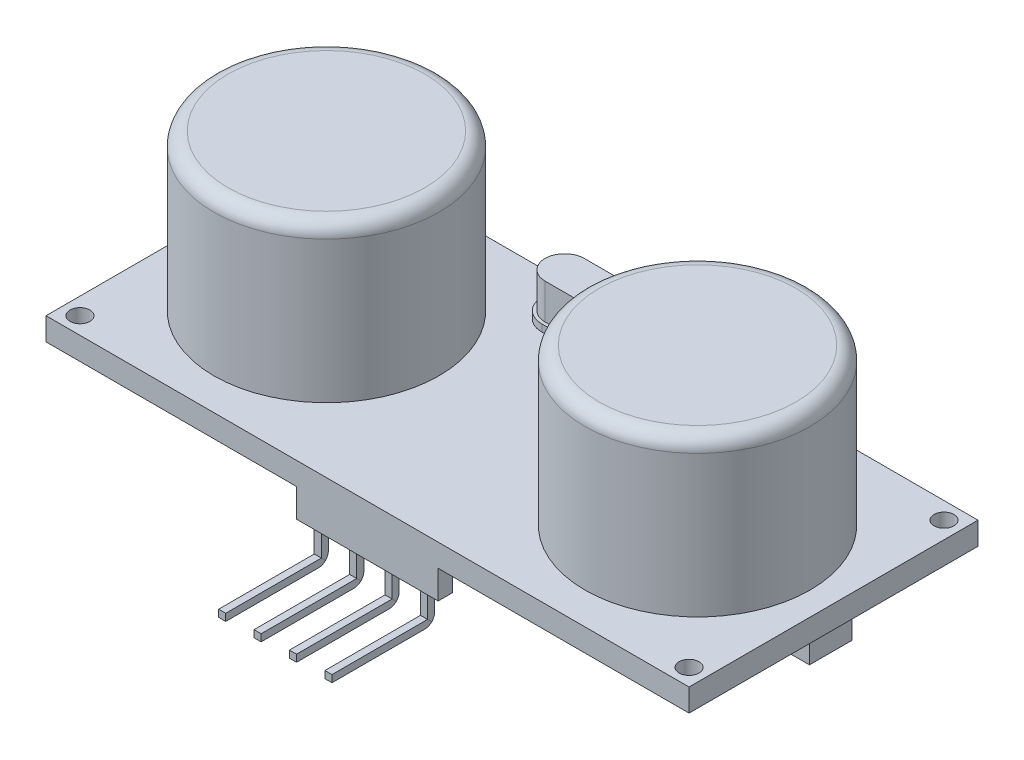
from build123d import *

# Parameters (mm, degrees)
CROQUIS1_W              = 45.4
CROQUIS1_H              = 20.4
SALIENTE_EXTRUIR1_DEPTH = 1.6
CROQUIS2_R              = 0.7
CORTAR_EXTRUIR1_DEPTH   = 1
SALIENTE_EXTRUIR2_DEPTH = 0.5
SALIENTE_EXTRUIR3_DEPTH = 3
CROQUIS9_R              = 7.95
SALIENTE_EXTRUIR4_DEPTH = 11
CROQUIS10_W             = 10
CROQUIS10_H             = 1
SALIENTE_EXTRUIR5_DEPTH = 2
CROQUIS12_W             = 0.5
CROQUIS12_H             = 0.5
REDONDEO4_R             = 0.7
MATRIZL1_COUNT          = 4
MATRIZL1_PITCH          = 2.5
REDONDEO5_R             = 1
CROQUIS13_W             = 9
CROQUIS13_H             = 3
SALIENTE_EXTRUIR6_DEPTH = 1.5
MATRIZL2_COUNT          = 2
MATRIZL2_PITCH          = 18
CROQUIS14_W             = 3
CROQUIS14_H             = 9
SALIENTE_EXTRUIR7_DEPTH = 1.5
REDONDEO6_R             = 0.7


with BuildPart() as part:
    # Croquis1 → Saliente-Extruir1 (new body)
    with BuildSketch(Plane(origin=(0, 0, 0), x_dir=(1, 0, 0), z_dir=(0, 1, 0))):
        Rectangle(CROQUIS1_W, CROQUIS1_H)
    extrude(amount=SALIENTE_EXTRUIR1_DEPTH)

    # Croquis2 → Cortar-Extruir1 (cut)
    with BuildSketch(Plane(origin=(0, 1.6, 0), x_dir=(1, 0, 0), z_dir=(0, 1, 0))):
        with Locations(Location((-21.5, 9, 0), (0, 0, 270))):
            Circle(CROQUIS2_R)
        with Locations(Location((21.5, 9, 0), (0, 0, 270))):
            Circle(CROQUIS2_R)
        with Locations(Location((21.5, -9, 0), (0, 0, 270))):
            Circle(CROQUIS2_R)
        with Locations(Location((-21.5, -9, 0), (0, 0, 270))):
            Circle(CROQUIS2_R)
    extrude(amount=-CORTAR_EXTRUIR1_DEPTH, mode=Mode.SUBTRACT)

    # Croquis3 → Saliente-Extruir2 (add)
    with BuildSketch(Plane(origin=(0, 1.6, 0), x_dir=(1, 0, 0), z_dir=(0, 1, 0))):
        with BuildLine():
            Line((-4.202221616, 9.535810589), (4.202221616, 9.535810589))
            ThreePointArc((4.202221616, 9.535810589), (5.818460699, 7.919571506), (4.202221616, 6.303332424))
            Line((4.202221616, 6.303332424), (-4.202221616, 6.303332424))
            ThreePointArc((-4.202221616, 6.303332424), (-5.818460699, 7.919571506), (-4.202221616, 9.535810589))
        make_face()
        with BuildLine():
            Line((-4.202221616, 9.304919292), (4.202221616, 9.304919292))
            ThreePointArc((4.202221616, 9.304919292), (5.587569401, 7.919571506), (4.202221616, 6.534223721))
            Line((4.202221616, 6.534223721), (-4.202221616, 6.534223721))
            ThreePointArc((-4.202221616, 6.534223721), (-5.587569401, 7.919571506), (-4.202221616, 9.304919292))
        make_face(mode=Mode.SUBTRACT)
    extrude(amount=SALIENTE_EXTRUIR2_DEPTH)

    # Croquis8 → Saliente-Extruir3 (add)
    with BuildSketch(Plane(origin=(0, 1.6, 0), x_dir=(1, 0, 0), z_dir=(0, 1, 0))):
        with BuildLine():
            Line((-4.202221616, 9.304919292), (4.202221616, 9.304919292))
            ThreePointArc((4.202221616, 9.304919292), (5.587569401, 7.919571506), (4.202221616, 6.534223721))
            Line((4.202221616, 6.534223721), (-4.202221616, 6.534223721))
            ThreePointArc((-4.202221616, 6.534223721), (-5.587569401, 7.919571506), (-4.202221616, 9.304919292))
        make_face()
    extrude(amount=SALIENTE_EXTRUIR3_DEPTH)

    # Croquis9 → Saliente-Extruir4 (add)
    with BuildSketch(Plane(origin=(0, 1.6, 0), x_dir=(1, 0, 0), z_dir=(0, 1, 0))):
        with Locations(Location((-13.1, 0, 0), (0, 0, 270))):
            Circle(CROQUIS9_R)
        with Locations(Location((13.1, 0, 0), (0, 0, 270))):
            Circle(CROQUIS9_R)
    extrude(amount=SALIENTE_EXTRUIR4_DEPTH)

    # Croquis10 → Saliente-Extruir5 (add)
    with BuildSketch(Plane.XZ):
        with Locations((-0.012747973, 9.7)):
            Rectangle(CROQUIS10_W, CROQUIS10_H)
    extrude(amount=SALIENTE_EXTRUIR5_DEPTH)

    # Barrer1: sweep along a curve in space
    with BuildLine() as barrer1_path:
        Line((-3.762747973, -2, 9.7), (-3.762747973, -4, 9.7))
        Line((-3.762747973, -4, 9.7), (-3.762747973, -4, 16.7))
    # Croquis12 → Barrer1 (sweep)
    with BuildSketch(Plane.XZ.offset(2)):
        with Locations((-3.762747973, 9.7)):
            Rectangle(CROQUIS12_W, CROQUIS12_H)
    barrer1 = sweep(path=barrer1_path.line, transition=Transition.RIGHT)

    # Redondeo4
    redondeo4_edges = [part.edges().sort_by_distance(p)[0] for p in [
        (-3.762747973, -4.25, 9.45),
    ]]
    fillet(redondeo4_edges, radius=REDONDEO4_R)

    # MatrizL1: Barrer1 ×4
    with Locations(*[(i * MATRIZL1_PITCH, 0, 0) for i in range(1, MATRIZL1_COUNT)]):
        add(barrer1)

    # Redondeo5
    redondeo5_edges = [part.edges().sort_by_distance(p)[0] for p in [
        (-13.1, 12.6, -7.95),
        (13.1, 12.6, -7.95),
    ]]
    fillet(redondeo5_edges, radius=REDONDEO5_R)

    # Croquis13 → Saliente-Extruir6 (add)
    with BuildSketch(Plane.XZ):
        Rectangle(CROQUIS13_W, CROQUIS13_H)
    saliente_extruir6 = extrude(amount=SALIENTE_EXTRUIR6_DEPTH)

    # MatrizL2: Saliente-Extruir6 ×2
    with Locations(*[(i * MATRIZL2_PITCH, 0, 0) for i in range(1, MATRIZL2_COUNT)]):
        add(saliente_extruir6)

    # Croquis14 → Saliente-Extruir7 (add)
    with BuildSketch(Plane.XZ):
        with Locations((-19.2, -0.292211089)):
            Rectangle(CROQUIS14_W, CROQUIS14_H)
    extrude(amount=SALIENTE_EXTRUIR7_DEPTH)

    # Redondeo6
    redondeo6_edges = [part.edges().sort_by_distance(p)[0] for p in [
        (-1.262747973, -4.25, 9.45),
        (1.237252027, -4.25, 9.45),
        (3.737252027, -4.25, 9.45),
    ]]
    fillet(redondeo6_edges, radius=REDONDEO6_R)


solid = part.part
